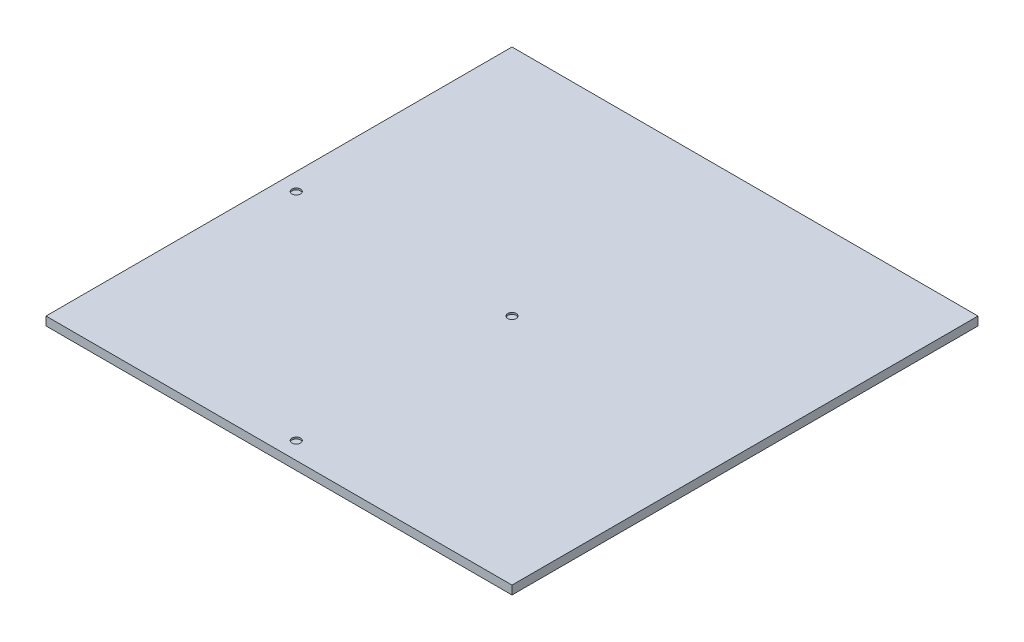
ISO-10303-21;
HEADER;
FILE_DESCRIPTION(('STEP AP214'),'2;1');
FILE_NAME('part.step','',(''),(''),'','','');
FILE_SCHEMA(('AUTOMOTIVE_DESIGN { 1 0 10303 214 1 1 1 1 }'));
ENDSEC;
DATA;
#1=APPLICATION_CONTEXT('core data for automotive mechanical design processes');
#2=APPLICATION_PROTOCOL_DEFINITION('international standard','automotive_design',2000,#1);
#3=PRODUCT_CONTEXT('',#1,'mechanical');
#4=PRODUCT('Part','Part','',(#3));
#5=PRODUCT_RELATED_PRODUCT_CATEGORY('part','',(#4));
#6=PRODUCT_DEFINITION_FORMATION('','',#4);
#7=PRODUCT_DEFINITION_CONTEXT('part definition',#1,'design');
#8=PRODUCT_DEFINITION('design','',#6,#7);
#9=PRODUCT_DEFINITION_SHAPE('','',#8);
#10=(LENGTH_UNIT() NAMED_UNIT(*) SI_UNIT(.MILLI.,.METRE.));
#11=(NAMED_UNIT(*) PLANE_ANGLE_UNIT() SI_UNIT($,.RADIAN.));
#12=(NAMED_UNIT(*) SI_UNIT($,.STERADIAN.) SOLID_ANGLE_UNIT());
#13=UNCERTAINTY_MEASURE_WITH_UNIT(LENGTH_MEASURE(1.E-05),#10,'distance_accuracy_value','');
#14=(GEOMETRIC_REPRESENTATION_CONTEXT(3) GLOBAL_UNCERTAINTY_ASSIGNED_CONTEXT((#13)) GLOBAL_UNIT_ASSIGNED_CONTEXT((#10,
#11,#12)) REPRESENTATION_CONTEXT('',''));
#15=CARTESIAN_POINT('',(0.,0.,0.));
#16=DIRECTION('',(0.,0.,1.));
#17=DIRECTION('',(1.,0.,0.));
#18=AXIS2_PLACEMENT_3D('',#15,#16,#17);
#19=CARTESIAN_POINT('',(0.,5.,0.));
#20=DIRECTION('',(1.,0.,0.));
#21=DIRECTION('',(0.,0.,-1.));
#22=AXIS2_PLACEMENT_3D('',#19,#20,#21);
#23=PLANE('',#22);
#24=DIRECTION('',(0.,0.,1.));
#25=VECTOR('',#24,1.);
#26=CARTESIAN_POINT('',(0.,0.,0.));
#27=LINE('',#26,#25);
#28=CARTESIAN_POINT('',(-1.11022302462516E-13,0.,-270.));
#29=VERTEX_POINT('',#28);
#30=CARTESIAN_POINT('',(0.,0.,0.));
#31=VERTEX_POINT('',#30);
#32=EDGE_CURVE('E97',#29,#31,#27,.T.);
#33=ORIENTED_EDGE('',*,*,#32,.T.);
#34=DIRECTION('',(0.,-1.,0.));
#35=VECTOR('',#34,1.);
#36=CARTESIAN_POINT('',(0.,5.,0.));
#37=LINE('',#36,#35);
#38=CARTESIAN_POINT('',(0.,5.,0.));
#39=VERTEX_POINT('',#38);
#40=EDGE_CURVE('E11',#39,#31,#37,.T.);
#41=ORIENTED_EDGE('',*,*,#40,.F.);
#42=DIRECTION('',(0.,0.,1.));
#43=VECTOR('',#42,1.);
#44=CARTESIAN_POINT('',(0.,5.,0.));
#45=LINE('',#44,#43);
#46=CARTESIAN_POINT('',(-1.11022302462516E-13,5.,-270.));
#47=VERTEX_POINT('',#46);
#48=EDGE_CURVE('E85',#47,#39,#45,.T.);
#49=ORIENTED_EDGE('',*,*,#48,.F.);
#50=DIRECTION('',(0.,-1.,0.));
#51=VECTOR('',#50,1.);
#52=CARTESIAN_POINT('',(-1.11022302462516E-13,5.,-270.));
#53=LINE('',#52,#51);
#54=EDGE_CURVE('E93',#47,#29,#53,.T.);
#55=ORIENTED_EDGE('',*,*,#54,.T.);
#56=EDGE_LOOP('',(#33,#41,#49,#55));
#57=FACE_BOUND('',#56,.T.);
#58=ADVANCED_FACE('F34',(#57),#23,.F.);
#59=CARTESIAN_POINT('',(0.,5.,0.));
#60=DIRECTION('',(0.,0.,-1.));
#61=DIRECTION('',(-1.,0.,0.));
#62=AXIS2_PLACEMENT_3D('',#59,#60,#61);
#63=PLANE('',#62);
#64=DIRECTION('',(1.,0.,0.));
#65=VECTOR('',#64,1.);
#66=CARTESIAN_POINT('',(0.,0.,0.));
#67=LINE('',#66,#65);
#68=CARTESIAN_POINT('',(270.,0.,0.));
#69=VERTEX_POINT('',#68);
#70=EDGE_CURVE('E89',#31,#69,#67,.T.);
#71=ORIENTED_EDGE('',*,*,#70,.T.);
#72=DIRECTION('',(0.,-1.,0.));
#73=VECTOR('',#72,1.);
#74=CARTESIAN_POINT('',(270.,5.,0.));
#75=LINE('',#74,#73);
#76=CARTESIAN_POINT('',(270.,5.,0.));
#77=VERTEX_POINT('',#76);
#78=EDGE_CURVE('E42',#77,#69,#75,.T.);
#79=ORIENTED_EDGE('',*,*,#78,.F.);
#80=DIRECTION('',(1.,0.,0.));
#81=VECTOR('',#80,1.);
#82=CARTESIAN_POINT('',(0.,5.,0.));
#83=LINE('',#82,#81);
#84=EDGE_CURVE('E80',#39,#77,#83,.T.);
#85=ORIENTED_EDGE('',*,*,#84,.F.);
#86=ORIENTED_EDGE('',*,*,#40,.T.);
#87=EDGE_LOOP('',(#71,#79,#85,#86));
#88=FACE_BOUND('',#87,.T.);
#89=ADVANCED_FACE('F88',(#88),#63,.F.);
#90=CARTESIAN_POINT('',(270.,5.,0.));
#91=DIRECTION('',(-1.,0.,0.));
#92=DIRECTION('',(0.,0.,1.));
#93=AXIS2_PLACEMENT_3D('',#90,#91,#92);
#94=PLANE('',#93);
#95=DIRECTION('',(0.,0.,-1.));
#96=VECTOR('',#95,1.);
#97=CARTESIAN_POINT('',(270.,0.,0.));
#98=LINE('',#97,#96);
#99=CARTESIAN_POINT('',(270.,0.,-270.));
#100=VERTEX_POINT('',#99);
#101=EDGE_CURVE('E67',#69,#100,#98,.T.);
#102=ORIENTED_EDGE('',*,*,#101,.T.);
#103=DIRECTION('',(0.,-1.,0.));
#104=VECTOR('',#103,1.);
#105=CARTESIAN_POINT('',(270.,5.,-270.));
#106=LINE('',#105,#104);
#107=CARTESIAN_POINT('',(270.,5.,-270.));
#108=VERTEX_POINT('',#107);
#109=EDGE_CURVE('E90',#108,#100,#106,.T.);
#110=ORIENTED_EDGE('',*,*,#109,.F.);
#111=DIRECTION('',(0.,0.,-1.));
#112=VECTOR('',#111,1.);
#113=CARTESIAN_POINT('',(270.,5.,0.));
#114=LINE('',#113,#112);
#115=EDGE_CURVE('E83',#77,#108,#114,.T.);
#116=ORIENTED_EDGE('',*,*,#115,.F.);
#117=ORIENTED_EDGE('',*,*,#78,.T.);
#118=EDGE_LOOP('',(#102,#110,#116,#117));
#119=FACE_BOUND('',#118,.T.);
#120=ADVANCED_FACE('F91',(#119),#94,.F.);
#121=CARTESIAN_POINT('',(-1.11022302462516E-13,5.,-270.));
#122=DIRECTION('',(0.,0.,1.));
#123=DIRECTION('',(1.,0.,0.));
#124=AXIS2_PLACEMENT_3D('',#121,#122,#123);
#125=PLANE('',#124);
#126=DIRECTION('',(-1.,0.,0.));
#127=VECTOR('',#126,1.);
#128=CARTESIAN_POINT('',(-1.11022302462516E-13,0.,-270.));
#129=LINE('',#128,#127);
#130=EDGE_CURVE('E73',#100,#29,#129,.T.);
#131=ORIENTED_EDGE('',*,*,#130,.T.);
#132=ORIENTED_EDGE('',*,*,#54,.F.);
#133=DIRECTION('',(-1.,0.,0.));
#134=VECTOR('',#133,1.);
#135=CARTESIAN_POINT('',(-1.11022302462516E-13,5.,-270.));
#136=LINE('',#135,#134);
#137=EDGE_CURVE('E50',#108,#47,#136,.T.);
#138=ORIENTED_EDGE('',*,*,#137,.F.);
#139=ORIENTED_EDGE('',*,*,#109,.T.);
#140=EDGE_LOOP('',(#131,#132,#138,#139));
#141=FACE_BOUND('',#140,.T.);
#142=ADVANCED_FACE('F105',(#141),#125,.F.);
#143=CARTESIAN_POINT('',(0.,5.,0.));
#144=DIRECTION('',(0.,-1.,0.));
#145=DIRECTION('',(0.,0.,-1.));
#146=AXIS2_PLACEMENT_3D('',#143,#144,#145);
#147=PLANE('',#146);
#148=CARTESIAN_POINT('',(10.,5.,-135.));
#149=DIRECTION('',(0.,1.,0.));
#150=DIRECTION('',(0.,0.,1.));
#151=AXIS2_PLACEMENT_3D('',#148,#149,#150);
#152=CIRCLE('',#151,2.5);
#153=CARTESIAN_POINT('',(10.,5.,-132.5));
#154=VERTEX_POINT('',#153);
#155=EDGE_CURVE('E123',#154,#154,#152,.T.);
#156=ORIENTED_EDGE('',*,*,#155,.F.);
#157=EDGE_LOOP('',(#156));
#158=FACE_BOUND('',#157,.T.);
#159=CARTESIAN_POINT('',(135.,5.,-10.));
#160=DIRECTION('',(0.,1.,0.));
#161=DIRECTION('',(0.,0.,1.));
#162=AXIS2_PLACEMENT_3D('',#159,#160,#161);
#163=CIRCLE('',#162,2.5);
#164=CARTESIAN_POINT('',(135.,5.,-7.50000000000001));
#165=VERTEX_POINT('',#164);
#166=EDGE_CURVE('E117',#165,#165,#163,.T.);
#167=ORIENTED_EDGE('',*,*,#166,.F.);
#168=EDGE_LOOP('',(#167));
#169=FACE_BOUND('',#168,.T.);
#170=CARTESIAN_POINT('',(135.,5.,-135.));
#171=DIRECTION('',(0.,1.,0.));
#172=DIRECTION('',(0.,0.,1.));
#173=AXIS2_PLACEMENT_3D('',#170,#171,#172);
#174=CIRCLE('',#173,2.5);
#175=CARTESIAN_POINT('',(135.,5.,-132.5));
#176=VERTEX_POINT('',#175);
#177=EDGE_CURVE('E111',#176,#176,#174,.T.);
#178=ORIENTED_EDGE('',*,*,#177,.F.);
#179=EDGE_LOOP('',(#178));
#180=FACE_BOUND('',#179,.T.);
#181=ORIENTED_EDGE('',*,*,#48,.T.);
#182=ORIENTED_EDGE('',*,*,#84,.T.);
#183=ORIENTED_EDGE('',*,*,#115,.T.);
#184=ORIENTED_EDGE('',*,*,#137,.T.);
#185=EDGE_LOOP('',(#181,#182,#183,#184));
#186=FACE_BOUND('',#185,.T.);
#187=ADVANCED_FACE('F81',(#158,#169,#180,#186),#147,.F.);
#188=CARTESIAN_POINT('',(0.,0.,0.));
#189=DIRECTION('',(0.,-1.,0.));
#190=DIRECTION('',(0.,0.,-1.));
#191=AXIS2_PLACEMENT_3D('',#188,#189,#190);
#192=PLANE('',#191);
#193=ORIENTED_EDGE('',*,*,#32,.F.);
#194=ORIENTED_EDGE('',*,*,#130,.F.);
#195=ORIENTED_EDGE('',*,*,#101,.F.);
#196=ORIENTED_EDGE('',*,*,#70,.F.);
#197=EDGE_LOOP('',(#193,#194,#195,#196));
#198=FACE_BOUND('',#197,.T.);
#199=ADVANCED_FACE('F108',(#198),#192,.T.);
#200=CARTESIAN_POINT('',(135.,4.,-135.));
#201=DIRECTION('',(0.,1.,0.));
#202=DIRECTION('',(0.,0.,1.));
#203=AXIS2_PLACEMENT_3D('',#200,#201,#202);
#204=CYLINDRICAL_SURFACE('',#203,2.5);
#205=CARTESIAN_POINT('',(135.,4.,-135.));
#206=DIRECTION('',(0.,1.,0.));
#207=DIRECTION('',(0.,0.,1.));
#208=AXIS2_PLACEMENT_3D('',#205,#206,#207);
#209=CIRCLE('',#208,2.5);
#210=CARTESIAN_POINT('',(135.,4.,-132.5));
#211=VERTEX_POINT('',#210);
#212=EDGE_CURVE('E100',#211,#211,#209,.T.);
#213=ORIENTED_EDGE('',*,*,#212,.F.);
#214=EDGE_LOOP('',(#213));
#215=FACE_BOUND('',#214,.T.);
#216=ORIENTED_EDGE('',*,*,#177,.T.);
#217=EDGE_LOOP('',(#216));
#218=FACE_BOUND('',#217,.T.);
#219=ADVANCED_FACE('F145',(#215,#218),#204,.F.);
#220=CARTESIAN_POINT('',(135.,4.,-135.));
#221=DIRECTION('',(0.,1.,0.));
#222=DIRECTION('',(0.,0.,1.));
#223=AXIS2_PLACEMENT_3D('',#220,#221,#222);
#224=PLANE('',#223);
#225=ORIENTED_EDGE('',*,*,#212,.T.);
#226=EDGE_LOOP('',(#225));
#227=FACE_BOUND('',#226,.T.);
#228=ADVANCED_FACE('F147',(#227),#224,.T.);
#229=CARTESIAN_POINT('',(135.,4.,-10.));
#230=DIRECTION('',(0.,1.,0.));
#231=DIRECTION('',(0.,0.,1.));
#232=AXIS2_PLACEMENT_3D('',#229,#230,#231);
#233=CYLINDRICAL_SURFACE('',#232,2.5);
#234=CARTESIAN_POINT('',(135.,4.,-10.));
#235=DIRECTION('',(0.,1.,0.));
#236=DIRECTION('',(0.,0.,1.));
#237=AXIS2_PLACEMENT_3D('',#234,#235,#236);
#238=CIRCLE('',#237,2.5);
#239=CARTESIAN_POINT('',(135.,4.,-7.50000000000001));
#240=VERTEX_POINT('',#239);
#241=EDGE_CURVE('E114',#240,#240,#238,.T.);
#242=ORIENTED_EDGE('',*,*,#241,.F.);
#243=EDGE_LOOP('',(#242));
#244=FACE_BOUND('',#243,.T.);
#245=ORIENTED_EDGE('',*,*,#166,.T.);
#246=EDGE_LOOP('',(#245));
#247=FACE_BOUND('',#246,.T.);
#248=ADVANCED_FACE('F154',(#244,#247),#233,.F.);
#249=CARTESIAN_POINT('',(135.,4.,-10.));
#250=DIRECTION('',(0.,1.,0.));
#251=DIRECTION('',(0.,0.,1.));
#252=AXIS2_PLACEMENT_3D('',#249,#250,#251);
#253=PLANE('',#252);
#254=ORIENTED_EDGE('',*,*,#241,.T.);
#255=EDGE_LOOP('',(#254));
#256=FACE_BOUND('',#255,.T.);
#257=ADVANCED_FACE('F134',(#256),#253,.T.);
#258=CARTESIAN_POINT('',(10.,4.,-135.));
#259=DIRECTION('',(0.,1.,0.));
#260=DIRECTION('',(0.,0.,1.));
#261=AXIS2_PLACEMENT_3D('',#258,#259,#260);
#262=CYLINDRICAL_SURFACE('',#261,2.5);
#263=CARTESIAN_POINT('',(10.,4.,-135.));
#264=DIRECTION('',(0.,1.,0.));
#265=DIRECTION('',(0.,0.,1.));
#266=AXIS2_PLACEMENT_3D('',#263,#264,#265);
#267=CIRCLE('',#266,2.5);
#268=CARTESIAN_POINT('',(10.,4.,-132.5));
#269=VERTEX_POINT('',#268);
#270=EDGE_CURVE('E120',#269,#269,#267,.T.);
#271=ORIENTED_EDGE('',*,*,#270,.F.);
#272=EDGE_LOOP('',(#271));
#273=FACE_BOUND('',#272,.T.);
#274=ORIENTED_EDGE('',*,*,#155,.T.);
#275=EDGE_LOOP('',(#274));
#276=FACE_BOUND('',#275,.T.);
#277=ADVANCED_FACE('F131',(#273,#276),#262,.F.);
#278=CARTESIAN_POINT('',(10.,4.,-135.));
#279=DIRECTION('',(0.,1.,0.));
#280=DIRECTION('',(0.,0.,1.));
#281=AXIS2_PLACEMENT_3D('',#278,#279,#280);
#282=PLANE('',#281);
#283=ORIENTED_EDGE('',*,*,#270,.T.);
#284=EDGE_LOOP('',(#283));
#285=FACE_BOUND('',#284,.T.);
#286=ADVANCED_FACE('F129',(#285),#282,.T.);
#287=CLOSED_SHELL('',(#58,#89,#120,#142,#187,#199,#219,#228,#248,#257,#277,#286));
#288=MANIFOLD_SOLID_BREP('B2',#287);
#289=ADVANCED_BREP_SHAPE_REPRESENTATION('',(#18,#288),#14);
#290=SHAPE_DEFINITION_REPRESENTATION(#9,#289);
ENDSEC;
END-ISO-10303-21;
